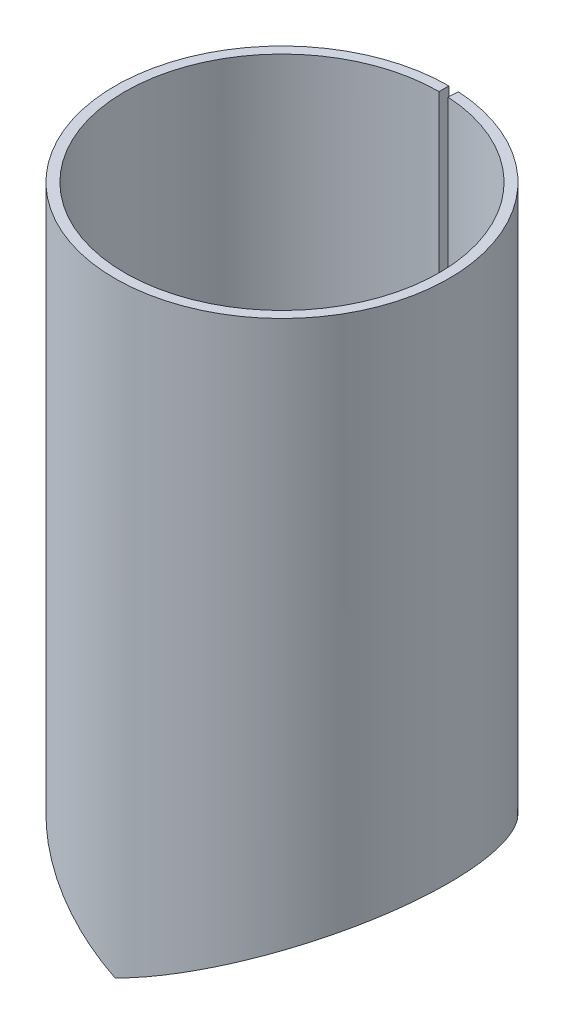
ISO-10303-21;
HEADER;
FILE_DESCRIPTION(('STEP AP214'),'2;1');
FILE_NAME('part.step','',(''),(''),'','','');
FILE_SCHEMA(('AUTOMOTIVE_DESIGN { 1 0 10303 214 1 1 1 1 }'));
ENDSEC;
DATA;
#1=APPLICATION_CONTEXT('core data for automotive mechanical design processes');
#2=APPLICATION_PROTOCOL_DEFINITION('international standard','automotive_design',2000,#1);
#3=PRODUCT_CONTEXT('',#1,'mechanical');
#4=PRODUCT('Part','Part','',(#3));
#5=PRODUCT_RELATED_PRODUCT_CATEGORY('part','',(#4));
#6=PRODUCT_DEFINITION_FORMATION('','',#4);
#7=PRODUCT_DEFINITION_CONTEXT('part definition',#1,'design');
#8=PRODUCT_DEFINITION('design','',#6,#7);
#9=PRODUCT_DEFINITION_SHAPE('','',#8);
#10=(LENGTH_UNIT() NAMED_UNIT(*) SI_UNIT(.MILLI.,.METRE.));
#11=(NAMED_UNIT(*) PLANE_ANGLE_UNIT() SI_UNIT($,.RADIAN.));
#12=(NAMED_UNIT(*) SI_UNIT($,.STERADIAN.) SOLID_ANGLE_UNIT());
#13=UNCERTAINTY_MEASURE_WITH_UNIT(LENGTH_MEASURE(1.E-05),#10,'distance_accuracy_value','');
#14=(GEOMETRIC_REPRESENTATION_CONTEXT(3) GLOBAL_UNCERTAINTY_ASSIGNED_CONTEXT((#13)) GLOBAL_UNIT_ASSIGNED_CONTEXT((#10,
#11,#12)) REPRESENTATION_CONTEXT('',''));
#15=CARTESIAN_POINT('',(0.,0.,0.));
#16=DIRECTION('',(0.,0.,1.));
#17=DIRECTION('',(1.,0.,0.));
#18=AXIS2_PLACEMENT_3D('',#15,#16,#17);
#19=CARTESIAN_POINT('',(0.941097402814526,31.0541779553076,-15.9494394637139));
#20=DIRECTION('',(-0.998263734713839,0.,-0.0589025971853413));
#21=DIRECTION('',(0.,1.,0.));
#22=AXIS2_PLACEMENT_3D('',#19,#20,#21);
#23=PLANE('',#22);
#24=CARTESIAN_POINT('',(0.94109740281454,0.493059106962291,-15.9494394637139));
#25=CARTESIAN_POINT('',(0.999999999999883,0.493059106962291,-16.9477031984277));
#26=B_SPLINE_CURVE_WITH_KNOTS('',1,(#24,#25),.UNSPECIFIED.,.F.,.F.,(2,2),(0.,1.),.UNSPECIFIED.);
#27=CARTESIAN_POINT('',(0.941097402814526,0.49305910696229,-15.9494394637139));
#28=VERTEX_POINT('',#27);
#29=CARTESIAN_POINT('',(0.999999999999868,0.49305910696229,-16.9477031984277));
#30=VERTEX_POINT('',#29);
#31=EDGE_CURVE('E13',#28,#30,#26,.T.);
#32=ORIENTED_EDGE('',*,*,#31,.F.);
#33=DIRECTION('',(0.,1.,0.));
#34=VECTOR('',#33,1.);
#35=CARTESIAN_POINT('',(0.941097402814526,0.49305910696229,-15.9494394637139));
#36=LINE('',#35,#34);
#37=CARTESIAN_POINT('',(0.941097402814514,61.615296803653,-15.9494394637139));
#38=VERTEX_POINT('',#37);
#39=EDGE_CURVE('E150',#28,#38,#36,.T.);
#40=ORIENTED_EDGE('',*,*,#39,.T.);
#41=DIRECTION('',(0.0589025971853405,0.,-0.998263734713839));
#42=VECTOR('',#41,1.);
#43=CARTESIAN_POINT('',(0.941097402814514,61.615296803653,-15.9494394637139));
#44=LINE('',#43,#42);
#45=CARTESIAN_POINT('',(0.999999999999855,61.615296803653,-16.9477031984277));
#46=VERTEX_POINT('',#45);
#47=EDGE_CURVE('E52',#38,#46,#44,.T.);
#48=ORIENTED_EDGE('',*,*,#47,.T.);
#49=DIRECTION('',(0.,-1.,0.));
#50=VECTOR('',#49,1.);
#51=CARTESIAN_POINT('',(0.999999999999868,178.606492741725,-16.9477031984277));
#52=LINE('',#51,#50);
#53=EDGE_CURVE('E111',#30,#46,#52,.F.);
#54=ORIENTED_EDGE('',*,*,#53,.F.);
#55=EDGE_LOOP('',(#32,#40,#48,#54));
#56=FACE_BOUND('',#55,.T.);
#57=ADVANCED_FACE('F38',(#56),#23,.T.);
#58=CARTESIAN_POINT('',(0.,61.615296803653,0.));
#59=DIRECTION('',(0.,-1.,0.));
#60=DIRECTION('',(0.,0.,-1.));
#61=AXIS2_PLACEMENT_3D('',#58,#59,#60);
#62=PLANE('',#61);
#63=ORIENTED_EDGE('',*,*,#47,.F.);
#64=CARTESIAN_POINT('',(0.,61.615296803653,0.));
#65=DIRECTION('',(0.,1.,0.));
#66=DIRECTION('',(0.,0.,1.));
#67=AXIS2_PLACEMENT_3D('',#64,#65,#66);
#68=CIRCLE('',#67,15.9771800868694);
#69=CARTESIAN_POINT('',(0.,61.615296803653,-15.9771800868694));
#70=VERTEX_POINT('',#69);
#71=EDGE_CURVE('E101',#70,#38,#68,.T.);
#72=ORIENTED_EDGE('',*,*,#71,.F.);
#73=DIRECTION('',(0.,0.,-1.));
#74=VECTOR('',#73,1.);
#75=CARTESIAN_POINT('',(0.,61.615296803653,-15.9771800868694));
#76=LINE('',#75,#74);
#77=CARTESIAN_POINT('',(0.,61.615296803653,-16.9771800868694));
#78=VERTEX_POINT('',#77);
#79=EDGE_CURVE('E97',#70,#78,#76,.T.);
#80=ORIENTED_EDGE('',*,*,#79,.T.);
#81=CARTESIAN_POINT('',(0.,61.615296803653,0.));
#82=DIRECTION('',(0.,-1.,0.));
#83=DIRECTION('',(0.,0.,-1.));
#84=AXIS2_PLACEMENT_3D('',#81,#82,#83);
#85=CIRCLE('',#84,16.9771800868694);
#86=EDGE_CURVE('E100',#78,#46,#85,.F.);
#87=ORIENTED_EDGE('',*,*,#86,.T.);
#88=EDGE_LOOP('',(#63,#72,#80,#87));
#89=FACE_BOUND('',#88,.T.);
#90=ADVANCED_FACE('F99',(#89),#62,.F.);
#91=CARTESIAN_POINT('',(0.,30.8076484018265,-15.9771800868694));
#92=DIRECTION('',(-1.,0.,0.));
#93=DIRECTION('',(0.,1.,0.));
#94=AXIS2_PLACEMENT_3D('',#91,#92,#93);
#95=PLANE('',#94);
#96=ORIENTED_EDGE('',*,*,#79,.F.);
#97=DIRECTION('',(0.,1.,0.));
#98=VECTOR('',#97,1.);
#99=CARTESIAN_POINT('',(0.,0.,-15.9771800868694));
#100=LINE('',#99,#98);
#101=CARTESIAN_POINT('',(0.,0.,-15.9771800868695));
#102=VERTEX_POINT('',#101);
#103=EDGE_CURVE('E151',#102,#70,#100,.T.);
#104=ORIENTED_EDGE('',*,*,#103,.F.);
#105=CARTESIAN_POINT('',(0.,0.,-16.9771800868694));
#106=CARTESIAN_POINT('',(0.,0.,-15.9771800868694));
#107=B_SPLINE_CURVE_WITH_KNOTS('',1,(#105,#106),.UNSPECIFIED.,.F.,.F.,(2,2),(0.,1.),.UNSPECIFIED.);
#108=CARTESIAN_POINT('',(0.,0.,-16.9771800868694));
#109=VERTEX_POINT('',#108);
#110=EDGE_CURVE('E93',#102,#109,#107,.F.);
#111=ORIENTED_EDGE('',*,*,#110,.T.);
#112=DIRECTION('',(0.,-1.,0.));
#113=VECTOR('',#112,1.);
#114=CARTESIAN_POINT('',(0.,178.606492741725,-16.9771800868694));
#115=LINE('',#114,#113);
#116=EDGE_CURVE('E108',#109,#78,#115,.F.);
#117=ORIENTED_EDGE('',*,*,#116,.T.);
#118=EDGE_LOOP('',(#96,#104,#111,#117));
#119=FACE_BOUND('',#118,.T.);
#120=ADVANCED_FACE('F113',(#119),#95,.F.);
#121=CARTESIAN_POINT('',(0.,0.,-16.9771800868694));
#122=CARTESIAN_POINT('',(-0.789612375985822,0.389318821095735,-16.9771800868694));
#123=CARTESIAN_POINT('',(-1.46662508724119,0.722575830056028,-16.9232026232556));
#124=CARTESIAN_POINT('',(-2.31055936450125,1.13886504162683,-16.8216004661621));
#125=CARTESIAN_POINT('',(-2.56336455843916,1.26366781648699,-16.7840888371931));
#126=CARTESIAN_POINT('',(-2.90022889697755,1.42993153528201,-16.7280086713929));
#127=CARTESIAN_POINT('',(-3.00546348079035,1.48186270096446,-16.7093331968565));
#128=CARTESIAN_POINT('',(-3.20192488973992,1.57874488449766,-16.6728013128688));
#129=CARTESIAN_POINT('',(-3.29705064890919,1.62563711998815,-16.6542346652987));
#130=CARTESIAN_POINT('',(-4.15347149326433,2.04782411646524,-16.4795915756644));
#131=CARTESIAN_POINT('',(-4.85290902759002,2.39257341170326,-16.2827270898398));
#132=CARTESIAN_POINT('',(-5.64927110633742,2.78534998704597,-16.0105811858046));
#133=CARTESIAN_POINT('',(-5.80466751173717,2.86199729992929,-15.9548321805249));
#134=CARTESIAN_POINT('',(-6.10776721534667,3.01147592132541,-15.8412756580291));
#135=CARTESIAN_POINT('',(-6.25504184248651,3.08408934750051,-15.7836574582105));
#136=CARTESIAN_POINT('',(-6.69215517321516,3.2995879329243,-15.6057262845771));
#137=CARTESIAN_POINT('',(-6.97540379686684,3.43920986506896,-15.4809847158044));
#138=CARTESIAN_POINT('',(-7.80043637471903,3.84594428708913,-15.0913168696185));
#139=CARTESIAN_POINT('',(-8.31743843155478,4.10092540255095,-14.8109961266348));
#140=CARTESIAN_POINT('',(-9.04386814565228,4.45913432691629,-14.370569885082));
#141=CARTESIAN_POINT('',(-9.27785089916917,4.57447908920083,-14.2204857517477));
#142=CARTESIAN_POINT('',(-9.73493463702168,4.79981380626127,-13.9115700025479));
#143=CARTESIAN_POINT('',(-9.95734719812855,4.90946228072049,-13.7531398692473));
#144=CARTESIAN_POINT('',(-10.6061380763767,5.22935105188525,-13.2674934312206));
#145=CARTESIAN_POINT('',(-11.0140382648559,5.43053469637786,-12.9299414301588));
#146=CARTESIAN_POINT('',(-11.781085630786,5.80875091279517,-12.2351316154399));
#147=CARTESIAN_POINT('',(-12.141354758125,5.98630554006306,-11.8770482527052));
#148=CARTESIAN_POINT('',(-12.8220763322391,6.32191989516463,-11.138722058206));
#149=CARTESIAN_POINT('',(-13.1415079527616,6.47945821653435,-10.7593821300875));
#150=CARTESIAN_POINT('',(-13.7387438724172,6.77399714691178,-9.985512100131));
#151=CARTESIAN_POINT('',(-14.016292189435,6.91081843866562,-9.59151371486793));
#152=CARTESIAN_POINT('',(-14.534257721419,7.16615948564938,-8.78686147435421));
#153=CARTESIAN_POINT('',(-14.7741403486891,7.28443147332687,-8.37681787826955));
#154=CARTESIAN_POINT('',(-15.4364534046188,7.611051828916,-7.12931822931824));
#155=CARTESIAN_POINT('',(-15.8012941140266,7.79090401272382,-6.27648734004));
#156=CARTESIAN_POINT('',(-16.3882178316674,8.07975035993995,-4.52785879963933));
#157=CARTESIAN_POINT('',(-16.6086035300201,8.18824656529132,-3.63460316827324));
#158=CARTESIAN_POINT('',(-16.902355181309,8.33338503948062,-1.83478629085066));
#159=CARTESIAN_POINT('',(-16.975732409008,8.37002730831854,-0.92824605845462));
#160=CARTESIAN_POINT('',(-16.9785852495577,8.37145790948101,0.874513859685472));
#161=CARTESIAN_POINT('',(-16.9081099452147,8.33623801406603,1.78090553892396));
#162=CARTESIAN_POINT('',(-16.6201527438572,8.19392681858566,3.58138649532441));
#163=CARTESIAN_POINT('',(-16.4026589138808,8.08683568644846,4.47524953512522));
#164=CARTESIAN_POINT('',(-15.9667096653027,7.87229568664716,5.78804238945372));
#165=CARTESIAN_POINT('',(-15.8031405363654,7.79179846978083,6.22096705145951));
#166=CARTESIAN_POINT('',(-15.4399863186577,7.61283626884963,7.07435540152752));
#167=CARTESIAN_POINT('',(-15.240004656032,7.51417964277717,7.49589384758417));
#168=CARTESIAN_POINT('',(-14.8012950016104,7.29782721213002,8.32873536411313));
#169=CARTESIAN_POINT('',(-14.5628024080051,7.18023536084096,8.73946825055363));
#170=CARTESIAN_POINT('',(-14.0475346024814,6.92622038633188,9.54569488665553));
#171=CARTESIAN_POINT('',(-13.7713177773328,6.79006277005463,9.94052794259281));
#172=CARTESIAN_POINT('',(-13.1769334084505,6.49693655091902,10.715956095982));
#173=CARTESIAN_POINT('',(-12.8589289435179,6.34010018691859,11.0961450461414));
#174=CARTESIAN_POINT('',(-12.1810507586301,6.00588095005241,11.8363208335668));
#175=CARTESIAN_POINT('',(-11.8221277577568,5.82898709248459,12.1954549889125));
#176=CARTESIAN_POINT('',(-11.0582967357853,5.45235163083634,12.8920867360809));
#177=CARTESIAN_POINT('',(-10.6518358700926,5.25185849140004,13.2308282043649));
#178=CARTESIAN_POINT('',(-10.0048652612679,4.93285566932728,13.7186099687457));
#179=CARTESIAN_POINT('',(-9.78300305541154,4.82347754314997,13.8778101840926));
#180=CARTESIAN_POINT('',(-9.32689389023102,4.59863358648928,14.1883689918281));
#181=CARTESIAN_POINT('',(-9.09334758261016,4.48352227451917,14.3393100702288));
#182=CARTESIAN_POINT('',(-8.36865177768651,4.12620252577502,14.7821131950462));
#183=CARTESIAN_POINT('',(-7.85207500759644,3.87140409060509,15.0645724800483));
#184=CARTESIAN_POINT('',(-7.02637586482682,3.46432853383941,15.4579310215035));
#185=CARTESIAN_POINT('',(-6.7426880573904,3.32449036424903,15.5839823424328));
#186=CARTESIAN_POINT('',(-6.30456963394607,3.1085136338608,15.7639453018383));
#187=CARTESIAN_POINT('',(-6.15705796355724,3.03579573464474,15.8221862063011));
#188=CARTESIAN_POINT('',(-5.85370898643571,2.88620787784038,15.9369077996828));
#189=CARTESIAN_POINT('',(-5.69803379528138,2.80942416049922,15.9932985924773));
#190=CARTESIAN_POINT('',(-4.89948053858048,2.4155566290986,16.2688800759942));
#191=CARTESIAN_POINT('',(-4.19572167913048,2.06862598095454,16.4692457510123));
#192=CARTESIAN_POINT('',(-3.33129422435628,1.64251280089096,16.6474244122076));
#193=CARTESIAN_POINT('',(-3.23424319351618,1.5946694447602,16.666561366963));
#194=CARTESIAN_POINT('',(-3.03814649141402,1.49798783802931,16.7034206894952));
#195=CARTESIAN_POINT('',(-2.93320155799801,1.44620688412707,16.7222599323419));
#196=CARTESIAN_POINT('',(-2.59583940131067,1.27970644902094,16.7791025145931));
#197=CARTESIAN_POINT('',(-2.34161966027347,1.15419859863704,16.8173489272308));
#198=CARTESIAN_POINT('',(-1.49011294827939,0.73415236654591,16.9213256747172));
#199=CARTESIAN_POINT('',(-0.803588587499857,0.396208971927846,16.9771800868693));
#200=CARTESIAN_POINT('',(1.19083122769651E-13,0.,16.9771800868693));
#201=CARTESIAN_POINT('',(0.,0.,-15.9771800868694));
#202=CARTESIAN_POINT('',(-0.743096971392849,0.389316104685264,-15.9771800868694));
#203=CARTESIAN_POINT('',(-1.38023706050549,0.722575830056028,-15.9263820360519));
#204=CARTESIAN_POINT('',(-2.17446141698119,1.13886504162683,-15.8307645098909));
#205=CARTESIAN_POINT('',(-2.41237572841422,1.26366781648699,-15.7954624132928));
#206=CARTESIAN_POINT('',(-2.72939788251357,1.42993153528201,-15.7426855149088));
#207=CARTESIAN_POINT('',(-2.82843387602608,1.48186270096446,-15.7251100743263));
#208=CARTESIAN_POINT('',(-3.01332319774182,1.57874488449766,-15.6907300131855));
#209=CARTESIAN_POINT('',(-3.1028458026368,1.62563711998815,-15.6732569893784));
#210=CARTESIAN_POINT('',(-3.90882123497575,2.04782411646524,-15.508900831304));
#211=CARTESIAN_POINT('',(-4.56706008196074,2.39257341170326,-15.323632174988));
#212=CARTESIAN_POINT('',(-5.31651436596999,2.78534998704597,-15.0675163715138));
#213=CARTESIAN_POINT('',(-5.46275751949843,2.86199729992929,-15.0150511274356));
#214=CARTESIAN_POINT('',(-5.74800386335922,3.01147592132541,-14.9081833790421));
#215=CARTESIAN_POINT('',(-5.88660363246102,3.08408934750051,-14.853959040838));
#216=CARTESIAN_POINT('',(-6.29796985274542,3.2995879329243,-14.6865084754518));
#217=CARTESIAN_POINT('',(-6.56453439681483,3.43920986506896,-14.5691145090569));
#218=CARTESIAN_POINT('',(-7.34097041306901,3.84594428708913,-14.2023991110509));
#219=CARTESIAN_POINT('',(-7.82751970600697,4.10092540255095,-13.9385899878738));
#220=CARTESIAN_POINT('',(-8.51116082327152,4.45913432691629,-13.5241059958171));
#221=CARTESIAN_POINT('',(-8.73136138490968,4.57447908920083,-13.3828622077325));
#222=CARTESIAN_POINT('',(-9.16152170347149,4.79981380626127,-13.092142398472));
#223=CARTESIAN_POINT('',(-9.37083358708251,4.90946228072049,-12.9430442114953));
#224=CARTESIAN_POINT('',(-9.98140899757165,5.22935105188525,-12.4860036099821));
#225=CARTESIAN_POINT('',(-10.3652828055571,5.43053469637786,-12.168334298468));
#226=CARTESIAN_POINT('',(-11.0871490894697,5.80875091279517,-11.5144505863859));
#227=CARTESIAN_POINT('',(-11.4261974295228,5.98630554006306,-11.1774592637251));
#228=CARTESIAN_POINT('',(-12.0668227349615,6.32191989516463,-10.482622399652));
#229=CARTESIAN_POINT('',(-12.367439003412,6.47945821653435,-10.1256265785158));
#230=CARTESIAN_POINT('',(-12.9294961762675,6.77399714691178,-9.39733950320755));
#231=CARTESIAN_POINT('',(-13.1906961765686,6.91081843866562,-9.02654864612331));
#232=CARTESIAN_POINT('',(-13.6781521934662,7.16615948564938,-8.26929251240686));
#233=CARTESIAN_POINT('',(-13.9039051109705,7.28443147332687,-7.88340154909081));
#234=CARTESIAN_POINT('',(-14.5272062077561,7.611051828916,-6.70938286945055));
#235=CARTESIAN_POINT('',(-14.8705568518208,7.79090401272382,-5.90678593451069));
#236=CARTESIAN_POINT('',(-15.4229092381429,8.07975035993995,-4.26115615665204));
#237=CARTESIAN_POINT('',(-15.6303136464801,8.18824656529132,-3.42051560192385));
#238=CARTESIAN_POINT('',(-15.9067625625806,8.33338503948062,-1.72671261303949));
#239=CARTESIAN_POINT('',(-15.9758176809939,8.37002730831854,-0.873569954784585));
#240=CARTESIAN_POINT('',(-15.9785024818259,8.37145790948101,0.823002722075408));
#241=CARTESIAN_POINT('',(-15.9121783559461,8.33623801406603,1.67600557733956));
#242=CARTESIAN_POINT('',(-15.6411825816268,8.19392681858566,3.37043352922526));
#243=CARTESIAN_POINT('',(-15.4364997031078,8.08683568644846,4.21164571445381));
#244=CARTESIAN_POINT('',(-15.0262289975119,7.87229568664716,5.44711166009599));
#245=CARTESIAN_POINT('',(-14.8722945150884,7.79179846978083,5.85453593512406));
#246=CARTESIAN_POINT('',(-14.5305310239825,7.61283626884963,6.65765749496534));
#247=CARTESIAN_POINT('',(-14.3423288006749,7.51417964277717,7.05436623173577));
#248=CARTESIAN_POINT('',(-13.929460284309,7.29782721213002,7.8381512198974));
#249=CARTESIAN_POINT('',(-13.7050155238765,7.18023536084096,8.22469087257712));
#250=CARTESIAN_POINT('',(-13.2200983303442,6.92622038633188,8.98342866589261));
#251=CARTESIAN_POINT('',(-12.9601513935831,6.79006277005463,9.35500502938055));
#252=CARTESIAN_POINT('',(-12.4007778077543,6.49693655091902,10.0847584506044));
#253=CARTESIAN_POINT('',(-12.1015046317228,6.34010018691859,10.4425532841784));
#254=CARTESIAN_POINT('',(-11.4635552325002,6.00588095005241,11.1391307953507));
#255=CARTESIAN_POINT('',(-11.1257737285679,5.82898709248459,11.4771110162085));
#256=CARTESIAN_POINT('',(-10.4069343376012,5.45235163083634,12.132709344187));
#257=CARTESIAN_POINT('',(-10.0244150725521,5.25185849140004,12.4514980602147));
#258=CARTESIAN_POINT('',(-9.41555271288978,4.93285566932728,12.9105482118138));
#259=CARTESIAN_POINT('',(-9.20675876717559,4.82347754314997,13.0603711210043));
#260=CARTESIAN_POINT('',(-8.77751561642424,4.59863358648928,13.3526372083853));
#261=CARTESIAN_POINT('',(-8.55772579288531,4.48352227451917,13.4946874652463));
#262=CARTESIAN_POINT('',(-7.87571645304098,4.12620252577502,13.9114083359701));
#263=CARTESIAN_POINT('',(-7.38956739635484,3.87140409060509,14.1772300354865));
#264=CARTESIAN_POINT('',(-6.61250407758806,3.46432853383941,14.5474187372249));
#265=CARTESIAN_POINT('',(-6.34552621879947,3.32449036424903,14.6660453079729));
#266=CARTESIAN_POINT('',(-5.93321410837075,3.1085136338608,14.8354079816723));
#267=CARTESIAN_POINT('',(-5.79439125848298,3.03579573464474,14.8902183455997));
#268=CARTESIAN_POINT('',(-5.50891032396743,2.88620787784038,14.998182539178));
#269=CARTESIAN_POINT('',(-5.36240480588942,2.80942416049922,15.0512517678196));
#270=CARTESIAN_POINT('',(-4.61088840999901,2.4155566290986,15.3106007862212));
#271=CARTESIAN_POINT('',(-3.94858277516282,2.06862598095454,15.4991644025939));
#272=CARTESIAN_POINT('',(-3.13507234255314,1.64251280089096,15.6668478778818));
#273=CARTESIAN_POINT('',(-3.04373786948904,1.5946694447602,15.6848576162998));
#274=CARTESIAN_POINT('',(-2.85919177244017,1.49798783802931,15.7195458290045));
#275=CARTESIAN_POINT('',(-2.76042836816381,1.44620688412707,15.7372753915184));
#276=CARTESIAN_POINT('',(-2.44293771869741,1.27970644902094,15.7907697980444));
#277=CARTESIAN_POINT('',(-2.20369218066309,1.15419859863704,15.8267633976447));
#278=CARTESIAN_POINT('',(-1.40234142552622,0.73415236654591,15.9246156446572));
#279=CARTESIAN_POINT('',(-0.756249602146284,0.396206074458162,15.9771800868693));
#280=CARTESIAN_POINT('',(1.12299319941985E-13,0.,15.9771800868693));
#281=B_SPLINE_SURFACE_WITH_KNOTS('',1,3,((#121,#122,#123,#124,#125,#126,#127,#128,#129,#130,
#131,#132,#133,#134,#135,#136,#137,#138,#139,#140,#141,#142,#143,#144,#145,#146,#147,#148,#149,
#150,#151,#152,#153,#154,#155,#156,#157,#158,#159,#160,#161,#162,#163,#164,#165,#166,#167,#168,
#169,#170,#171,#172,#173,#174,#175,#176,#177,#178,#179,#180,#181,#182,#183,#184,#185,#186,#187,
#188,#189,#190,#191,#192,#193,#194,#195,#196,#197,#198,#199,#200),(#201,#202,#203,#204,#205,
#206,#207,#208,#209,#210,#211,#212,#213,#214,#215,#216,#217,#218,#219,#220,#221,#222,#223,#224,
#225,#226,#227,#228,#229,#230,#231,#232,#233,#234,#235,#236,#237,#238,#239,#240,#241,#242,#243,
#244,#245,#246,#247,#248,#249,#250,#251,#252,#253,#254,#255,#256,#257,#258,#259,#260,#261,#262,
#263,#264,#265,#266,#267,#268,#269,#270,#271,#272,#273,#274,#275,#276,#277,#278,#279,#280)),
.UNSPECIFIED.,.F.,.F.,.F.,(2,2),(4,2,2,2,2,2,2,2,2,2,2,2,2,2,2,2,2,2,2,2,2,2,2,2,2,2,2,2,2,2,2,
2,2,2,2,2,2,2,2,4),(0.,1.),(0.,0.015625,0.0234375,0.02734375,0.03125,0.0625,0.0703125,0.078125,
0.09375,0.125,0.140625,0.15625,0.1875,0.21875,0.25,0.28125,0.3125,0.375,0.4375,0.5,0.5625,0.625,
0.65625,0.6875,0.71875,0.75,0.78125,0.8125,0.84375,0.859375,0.875,0.90625,0.921875,0.9296875,
0.9375,0.96875,0.97265625,0.9765625,0.984375,1.),.UNSPECIFIED.);
#282=CARTESIAN_POINT('',(0.,0.,-15.9771800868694));
#283=CARTESIAN_POINT('',(-0.743096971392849,0.389316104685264,-15.9771800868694));
#284=CARTESIAN_POINT('',(-1.38023706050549,0.722575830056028,-15.9263820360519));
#285=CARTESIAN_POINT('',(-2.17446141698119,1.13886504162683,-15.8307645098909));
#286=CARTESIAN_POINT('',(-2.41237572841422,1.26366781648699,-15.7954624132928));
#287=CARTESIAN_POINT('',(-2.72939788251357,1.42993153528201,-15.7426855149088));
#288=CARTESIAN_POINT('',(-2.82843387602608,1.48186270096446,-15.7251100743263));
#289=CARTESIAN_POINT('',(-3.01332319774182,1.57874488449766,-15.6907300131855));
#290=CARTESIAN_POINT('',(-3.1028458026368,1.62563711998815,-15.6732569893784));
#291=CARTESIAN_POINT('',(-3.90882123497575,2.04782411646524,-15.508900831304));
#292=CARTESIAN_POINT('',(-4.56706008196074,2.39257341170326,-15.323632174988));
#293=CARTESIAN_POINT('',(-5.31651436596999,2.78534998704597,-15.0675163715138));
#294=CARTESIAN_POINT('',(-5.46275751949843,2.86199729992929,-15.0150511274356));
#295=CARTESIAN_POINT('',(-5.74800386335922,3.01147592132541,-14.9081833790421));
#296=CARTESIAN_POINT('',(-5.88660363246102,3.08408934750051,-14.853959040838));
#297=CARTESIAN_POINT('',(-6.29796985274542,3.2995879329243,-14.6865084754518));
#298=CARTESIAN_POINT('',(-6.56453439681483,3.43920986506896,-14.5691145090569));
#299=CARTESIAN_POINT('',(-7.34097041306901,3.84594428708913,-14.2023991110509));
#300=CARTESIAN_POINT('',(-7.82751970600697,4.10092540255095,-13.9385899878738));
#301=CARTESIAN_POINT('',(-8.51116082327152,4.45913432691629,-13.5241059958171));
#302=CARTESIAN_POINT('',(-8.73136138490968,4.57447908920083,-13.3828622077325));
#303=CARTESIAN_POINT('',(-9.16152170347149,4.79981380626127,-13.092142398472));
#304=CARTESIAN_POINT('',(-9.37083358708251,4.90946228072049,-12.9430442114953));
#305=CARTESIAN_POINT('',(-9.98140899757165,5.22935105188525,-12.4860036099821));
#306=CARTESIAN_POINT('',(-10.3652828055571,5.43053469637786,-12.168334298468));
#307=CARTESIAN_POINT('',(-11.0871490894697,5.80875091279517,-11.5144505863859));
#308=CARTESIAN_POINT('',(-11.4261974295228,5.98630554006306,-11.1774592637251));
#309=CARTESIAN_POINT('',(-12.0668227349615,6.32191989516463,-10.482622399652));
#310=CARTESIAN_POINT('',(-12.367439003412,6.47945821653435,-10.1256265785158));
#311=CARTESIAN_POINT('',(-12.9294961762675,6.77399714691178,-9.39733950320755));
#312=CARTESIAN_POINT('',(-13.1906961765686,6.91081843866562,-9.02654864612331));
#313=CARTESIAN_POINT('',(-13.6781521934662,7.16615948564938,-8.26929251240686));
#314=CARTESIAN_POINT('',(-13.9039051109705,7.28443147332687,-7.88340154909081));
#315=CARTESIAN_POINT('',(-14.5272062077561,7.611051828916,-6.70938286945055));
#316=CARTESIAN_POINT('',(-14.8705568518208,7.79090401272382,-5.90678593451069));
#317=CARTESIAN_POINT('',(-15.4229092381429,8.07975035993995,-4.26115615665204));
#318=CARTESIAN_POINT('',(-15.6303136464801,8.18824656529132,-3.42051560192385));
#319=CARTESIAN_POINT('',(-15.9067625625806,8.33338503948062,-1.72671261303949));
#320=CARTESIAN_POINT('',(-15.9758176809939,8.37002730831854,-0.873569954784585));
#321=CARTESIAN_POINT('',(-15.9785024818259,8.37145790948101,0.823002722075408));
#322=CARTESIAN_POINT('',(-15.9121783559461,8.33623801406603,1.67600557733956));
#323=CARTESIAN_POINT('',(-15.6411825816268,8.19392681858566,3.37043352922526));
#324=CARTESIAN_POINT('',(-15.4364997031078,8.08683568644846,4.21164571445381));
#325=CARTESIAN_POINT('',(-15.0262289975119,7.87229568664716,5.44711166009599));
#326=CARTESIAN_POINT('',(-14.8722945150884,7.79179846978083,5.85453593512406));
#327=CARTESIAN_POINT('',(-14.5305310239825,7.61283626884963,6.65765749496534));
#328=CARTESIAN_POINT('',(-14.3423288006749,7.51417964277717,7.05436623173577));
#329=CARTESIAN_POINT('',(-13.929460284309,7.29782721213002,7.8381512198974));
#330=CARTESIAN_POINT('',(-13.7050155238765,7.18023536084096,8.22469087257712));
#331=CARTESIAN_POINT('',(-13.2200983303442,6.92622038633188,8.98342866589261));
#332=CARTESIAN_POINT('',(-12.9601513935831,6.79006277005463,9.35500502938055));
#333=CARTESIAN_POINT('',(-12.4007778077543,6.49693655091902,10.0847584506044));
#334=CARTESIAN_POINT('',(-12.1015046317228,6.34010018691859,10.4425532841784));
#335=CARTESIAN_POINT('',(-11.4635552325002,6.00588095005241,11.1391307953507));
#336=CARTESIAN_POINT('',(-11.1257737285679,5.82898709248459,11.4771110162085));
#337=CARTESIAN_POINT('',(-10.4069343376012,5.45235163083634,12.132709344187));
#338=CARTESIAN_POINT('',(-10.0244150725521,5.25185849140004,12.4514980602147));
#339=CARTESIAN_POINT('',(-9.41555271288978,4.93285566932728,12.9105482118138));
#340=CARTESIAN_POINT('',(-9.20675876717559,4.82347754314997,13.0603711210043));
#341=CARTESIAN_POINT('',(-8.77751561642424,4.59863358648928,13.3526372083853));
#342=CARTESIAN_POINT('',(-8.55772579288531,4.48352227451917,13.4946874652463));
#343=CARTESIAN_POINT('',(-7.87571645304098,4.12620252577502,13.9114083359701));
#344=CARTESIAN_POINT('',(-7.38956739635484,3.87140409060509,14.1772300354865));
#345=CARTESIAN_POINT('',(-6.61250407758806,3.46432853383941,14.5474187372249));
#346=CARTESIAN_POINT('',(-6.34552621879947,3.32449036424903,14.6660453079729));
#347=CARTESIAN_POINT('',(-5.93321410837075,3.1085136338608,14.8354079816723));
#348=CARTESIAN_POINT('',(-5.79439125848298,3.03579573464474,14.8902183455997));
#349=CARTESIAN_POINT('',(-5.50891032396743,2.88620787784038,14.998182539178));
#350=CARTESIAN_POINT('',(-5.36240480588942,2.80942416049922,15.0512517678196));
#351=CARTESIAN_POINT('',(-4.61088840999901,2.4155566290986,15.3106007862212));
#352=CARTESIAN_POINT('',(-3.94858277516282,2.06862598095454,15.4991644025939));
#353=CARTESIAN_POINT('',(-3.13507234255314,1.64251280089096,15.6668478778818));
#354=CARTESIAN_POINT('',(-3.04373786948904,1.5946694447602,15.6848576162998));
#355=CARTESIAN_POINT('',(-2.85919177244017,1.49798783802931,15.7195458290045));
#356=CARTESIAN_POINT('',(-2.76042836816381,1.44620688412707,15.7372753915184));
#357=CARTESIAN_POINT('',(-2.44293771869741,1.27970644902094,15.7907697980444));
#358=CARTESIAN_POINT('',(-2.20369218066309,1.15419859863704,15.8267633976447));
#359=CARTESIAN_POINT('',(-1.40234142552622,0.73415236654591,15.9246156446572));
#360=CARTESIAN_POINT('',(-0.756249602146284,0.396206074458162,15.9771800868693));
#361=CARTESIAN_POINT('',(1.12299319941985E-13,0.,15.9771800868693));
#362=B_SPLINE_CURVE_WITH_KNOTS('',3,(#282,#283,#284,#285,#286,#287,#288,#289,#290,#291,#292,
#293,#294,#295,#296,#297,#298,#299,#300,#301,#302,#303,#304,#305,#306,#307,#308,#309,#310,#311,
#312,#313,#314,#315,#316,#317,#318,#319,#320,#321,#322,#323,#324,#325,#326,#327,#328,#329,#330,
#331,#332,#333,#334,#335,#336,#337,#338,#339,#340,#341,#342,#343,#344,#345,#346,#347,#348,#349,
#350,#351,#352,#353,#354,#355,#356,#357,#358,#359,#360,#361),.UNSPECIFIED.,.F.,.F.,(4,2,2,2,2,2,
2,2,2,2,2,2,2,2,2,2,2,2,2,2,2,2,2,2,2,2,2,2,2,2,2,2,2,2,2,2,2,2,2,4),(0.,0.015625,0.0234375,
0.02734375,0.03125,0.0625,0.0703125,0.078125,0.09375,0.125,0.140625,0.15625,0.1875,0.21875,0.25,
0.28125,0.3125,0.375,0.4375,0.5,0.5625,0.625,0.65625,0.6875,0.71875,0.75,0.78125,0.8125,0.84375,
0.859375,0.875,0.90625,0.921875,0.9296875,0.9375,0.96875,0.97265625,0.9765625,0.984375,1.),.UNSPECIFIED.);
#363=CARTESIAN_POINT('',(1.12299319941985E-13,0.,15.9771800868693));
#364=VERTEX_POINT('',#363);
#365=EDGE_CURVE('E154',#102,#364,#362,.T.);
#366=CARTESIAN_POINT('',(1.12299319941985E-13,0.,15.9771800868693));
#367=CARTESIAN_POINT('',(1.19083122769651E-13,0.,16.9771800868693));
#368=B_SPLINE_CURVE_WITH_KNOTS('',1,(#366,#367),.UNSPECIFIED.,.F.,.F.,(2,2),(0.,1.),.UNSPECIFIED.);
#369=CARTESIAN_POINT('',(-5.07065438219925E-07,2.50008429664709E-07,16.9771800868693));
#370=VERTEX_POINT('',#369);
#371=EDGE_CURVE('E269',#364,#370,#368,.T.);
#372=CARTESIAN_POINT('',(1.19083122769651E-13,0.,16.9771800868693));
#373=CARTESIAN_POINT('',(-0.803588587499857,0.396208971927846,16.9771800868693));
#374=CARTESIAN_POINT('',(-1.49011294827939,0.73415236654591,16.9213256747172));
#375=CARTESIAN_POINT('',(-2.34161966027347,1.15419859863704,16.8173489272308));
#376=CARTESIAN_POINT('',(-2.59583940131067,1.27970644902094,16.7791025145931));
#377=CARTESIAN_POINT('',(-2.93320155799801,1.44620688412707,16.7222599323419));
#378=CARTESIAN_POINT('',(-3.03814649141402,1.49798783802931,16.7034206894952));
#379=CARTESIAN_POINT('',(-3.23424319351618,1.5946694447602,16.666561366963));
#380=CARTESIAN_POINT('',(-3.33129422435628,1.64251280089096,16.6474244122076));
#381=CARTESIAN_POINT('',(-4.19572167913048,2.06862598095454,16.4692457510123));
#382=CARTESIAN_POINT('',(-4.89948053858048,2.4155566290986,16.2688800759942));
#383=CARTESIAN_POINT('',(-5.69803379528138,2.80942416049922,15.9932985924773));
#384=CARTESIAN_POINT('',(-5.85370898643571,2.88620787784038,15.9369077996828));
#385=CARTESIAN_POINT('',(-6.15705796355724,3.03579573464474,15.8221862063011));
#386=CARTESIAN_POINT('',(-6.30456963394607,3.1085136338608,15.7639453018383));
#387=CARTESIAN_POINT('',(-6.7426880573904,3.32449036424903,15.5839823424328));
#388=CARTESIAN_POINT('',(-7.02637586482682,3.46432853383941,15.4579310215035));
#389=CARTESIAN_POINT('',(-7.85207500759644,3.87140409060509,15.0645724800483));
#390=CARTESIAN_POINT('',(-8.36865177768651,4.12620252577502,14.7821131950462));
#391=CARTESIAN_POINT('',(-9.09334758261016,4.48352227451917,14.3393100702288));
#392=CARTESIAN_POINT('',(-9.32689389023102,4.59863358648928,14.1883689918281));
#393=CARTESIAN_POINT('',(-9.78300305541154,4.82347754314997,13.8778101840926));
#394=CARTESIAN_POINT('',(-10.0048652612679,4.93285566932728,13.7186099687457));
#395=CARTESIAN_POINT('',(-10.6518358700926,5.25185849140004,13.2308282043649));
#396=CARTESIAN_POINT('',(-11.0582967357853,5.45235163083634,12.8920867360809));
#397=CARTESIAN_POINT('',(-11.8221277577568,5.82898709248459,12.1954549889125));
#398=CARTESIAN_POINT('',(-12.1810507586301,6.00588095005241,11.8363208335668));
#399=CARTESIAN_POINT('',(-12.8589289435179,6.34010018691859,11.0961450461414));
#400=CARTESIAN_POINT('',(-13.1769334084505,6.49693655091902,10.715956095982));
#401=CARTESIAN_POINT('',(-13.7713177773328,6.79006277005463,9.94052794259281));
#402=CARTESIAN_POINT('',(-14.0475346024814,6.92622038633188,9.54569488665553));
#403=CARTESIAN_POINT('',(-14.5628024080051,7.18023536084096,8.73946825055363));
#404=CARTESIAN_POINT('',(-14.8012950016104,7.29782721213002,8.32873536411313));
#405=CARTESIAN_POINT('',(-15.240004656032,7.51417964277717,7.49589384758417));
#406=CARTESIAN_POINT('',(-15.4399863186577,7.61283626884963,7.07435540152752));
#407=CARTESIAN_POINT('',(-15.8031405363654,7.79179846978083,6.22096705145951));
#408=CARTESIAN_POINT('',(-15.9667096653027,7.87229568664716,5.78804238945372));
#409=CARTESIAN_POINT('',(-16.4026589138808,8.08683568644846,4.47524953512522));
#410=CARTESIAN_POINT('',(-16.6201527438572,8.19392681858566,3.58138649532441));
#411=CARTESIAN_POINT('',(-16.9081099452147,8.33623801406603,1.78090553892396));
#412=CARTESIAN_POINT('',(-16.9785852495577,8.37145790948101,0.874513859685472));
#413=CARTESIAN_POINT('',(-16.975732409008,8.37002730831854,-0.92824605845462));
#414=CARTESIAN_POINT('',(-16.902355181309,8.33338503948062,-1.83478629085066));
#415=CARTESIAN_POINT('',(-16.6086035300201,8.18824656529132,-3.63460316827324));
#416=CARTESIAN_POINT('',(-16.3882178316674,8.07975035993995,-4.52785879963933));
#417=CARTESIAN_POINT('',(-15.8012941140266,7.79090401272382,-6.27648734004));
#418=CARTESIAN_POINT('',(-15.4364534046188,7.611051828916,-7.12931822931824));
#419=CARTESIAN_POINT('',(-14.7741403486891,7.28443147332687,-8.37681787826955));
#420=CARTESIAN_POINT('',(-14.534257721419,7.16615948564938,-8.78686147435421));
#421=CARTESIAN_POINT('',(-14.016292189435,6.91081843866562,-9.59151371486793));
#422=CARTESIAN_POINT('',(-13.7387438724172,6.77399714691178,-9.985512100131));
#423=CARTESIAN_POINT('',(-13.1415079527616,6.47945821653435,-10.7593821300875));
#424=CARTESIAN_POINT('',(-12.8220763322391,6.32191989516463,-11.138722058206));
#425=CARTESIAN_POINT('',(-12.141354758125,5.98630554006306,-11.8770482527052));
#426=CARTESIAN_POINT('',(-11.781085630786,5.80875091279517,-12.2351316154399));
#427=CARTESIAN_POINT('',(-11.0140382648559,5.43053469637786,-12.9299414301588));
#428=CARTESIAN_POINT('',(-10.6061380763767,5.22935105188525,-13.2674934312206));
#429=CARTESIAN_POINT('',(-9.95734719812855,4.90946228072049,-13.7531398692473));
#430=CARTESIAN_POINT('',(-9.73493463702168,4.79981380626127,-13.9115700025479));
#431=CARTESIAN_POINT('',(-9.27785089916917,4.57447908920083,-14.2204857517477));
#432=CARTESIAN_POINT('',(-9.04386814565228,4.45913432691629,-14.370569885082));
#433=CARTESIAN_POINT('',(-8.31743843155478,4.10092540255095,-14.8109961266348));
#434=CARTESIAN_POINT('',(-7.80043637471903,3.84594428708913,-15.0913168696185));
#435=CARTESIAN_POINT('',(-6.97540379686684,3.43920986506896,-15.4809847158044));
#436=CARTESIAN_POINT('',(-6.69215517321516,3.2995879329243,-15.6057262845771));
#437=CARTESIAN_POINT('',(-6.25504184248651,3.08408934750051,-15.7836574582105));
#438=CARTESIAN_POINT('',(-6.10776721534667,3.01147592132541,-15.8412756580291));
#439=CARTESIAN_POINT('',(-5.80466751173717,2.86199729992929,-15.9548321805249));
#440=CARTESIAN_POINT('',(-5.64927110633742,2.78534998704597,-16.0105811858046));
#441=CARTESIAN_POINT('',(-4.85290902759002,2.39257341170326,-16.2827270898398));
#442=CARTESIAN_POINT('',(-4.15347149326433,2.04782411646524,-16.4795915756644));
#443=CARTESIAN_POINT('',(-3.29705064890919,1.62563711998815,-16.6542346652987));
#444=CARTESIAN_POINT('',(-3.20192488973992,1.57874488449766,-16.6728013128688));
#445=CARTESIAN_POINT('',(-3.00546348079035,1.48186270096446,-16.7093331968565));
#446=CARTESIAN_POINT('',(-2.90022889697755,1.42993153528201,-16.7280086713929));
#447=CARTESIAN_POINT('',(-2.56336455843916,1.26366781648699,-16.7840888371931));
#448=CARTESIAN_POINT('',(-2.31055936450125,1.13886504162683,-16.8216004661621));
#449=CARTESIAN_POINT('',(-1.46662508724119,0.722575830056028,-16.9232026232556));
#450=CARTESIAN_POINT('',(-0.789612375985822,0.389318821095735,-16.9771800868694));
#451=CARTESIAN_POINT('',(0.,0.,-16.9771800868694));
#452=B_SPLINE_CURVE_WITH_KNOTS('',3,(#372,#373,#374,#375,#376,#377,#378,#379,#380,#381,#382,
#383,#384,#385,#386,#387,#388,#389,#390,#391,#392,#393,#394,#395,#396,#397,#398,#399,#400,#401,
#402,#403,#404,#405,#406,#407,#408,#409,#410,#411,#412,#413,#414,#415,#416,#417,#418,#419,#420,
#421,#422,#423,#424,#425,#426,#427,#428,#429,#430,#431,#432,#433,#434,#435,#436,#437,#438,#439,
#440,#441,#442,#443,#444,#445,#446,#447,#448,#449,#450,#451),.UNSPECIFIED.,.F.,.F.,(4,2,2,2,2,2,
2,2,2,2,2,2,2,2,2,2,2,2,2,2,2,2,2,2,2,2,2,2,2,2,2,2,2,2,2,2,2,2,2,4),(0.,0.015625,0.0234375,
0.02734375,0.03125,0.0625,0.0703125,0.078125,0.09375,0.125,0.140625,0.15625,0.1875,0.21875,0.25,
0.28125,0.3125,0.34375,0.375,0.4375,0.5,0.5625,0.625,0.6875,0.71875,0.75,0.78125,0.8125,0.84375,
0.859375,0.875,0.90625,0.921875,0.9296875,0.9375,0.96875,0.97265625,0.9765625,0.984375,1.),.UNSPECIFIED.);
#453=EDGE_CURVE('E114',#109,#370,#452,.F.);
#454=ORIENTED_EDGE('',*,*,#110,.F.);
#455=ORIENTED_EDGE('',*,*,#365,.T.);
#456=ORIENTED_EDGE('',*,*,#371,.T.);
#457=ORIENTED_EDGE('',*,*,#453,.F.);
#458=EDGE_LOOP('',(#454,#455,#456,#457));
#459=FACE_BOUND('',#458,.T.);
#460=ADVANCED_FACE('F139',(#459),#281,.T.);
#461=CARTESIAN_POINT('',(1.19083122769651E-13,0.,16.9771800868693));
#462=CARTESIAN_POINT('',(0.794864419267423,0.39190859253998,16.9771800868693));
#463=CARTESIAN_POINT('',(1.47329775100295,0.725887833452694,16.9225453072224));
#464=CARTESIAN_POINT('',(2.31374267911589,1.14047675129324,16.8211433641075));
#465=CARTESIAN_POINT('',(2.56445148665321,1.26424783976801,16.7838816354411));
#466=CARTESIAN_POINT('',(2.89680168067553,1.42826664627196,16.7285921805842));
#467=CARTESIAN_POINT('',(2.99931875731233,1.47884246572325,16.7104322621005));
#468=CARTESIAN_POINT('',(3.19414285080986,1.57490042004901,16.674288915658));
#469=CARTESIAN_POINT('',(3.29057205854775,1.62243879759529,16.6555175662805));
#470=CARTESIAN_POINT('',(4.14953366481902,2.04586879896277,16.4806895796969));
#471=CARTESIAN_POINT('',(4.84937165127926,2.39085264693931,16.2837219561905));
#472=CARTESIAN_POINT('',(5.64412565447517,2.78283448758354,16.0123920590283));
#473=CARTESIAN_POINT('',(5.79909559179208,2.859268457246,15.9568523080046));
#474=CARTESIAN_POINT('',(6.10113978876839,3.00821159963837,15.8438233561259));
#475=CARTESIAN_POINT('',(6.24860737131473,3.0809127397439,15.7862083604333));
#476=CARTESIAN_POINT('',(6.68647262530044,3.29677490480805,15.6081717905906));
#477=CARTESIAN_POINT('',(6.97002091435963,3.43654849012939,15.483410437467));
#478=CARTESIAN_POINT('',(7.79538536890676,3.84346567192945,15.0939324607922));
#479=CARTESIAN_POINT('',(8.31185102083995,4.09820569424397,14.8140742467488));
#480=CARTESIAN_POINT('',(9.27808807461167,4.57460954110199,14.2288701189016));
#481=CARTESIAN_POINT('',(9.73445071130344,4.79955680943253,13.9196417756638));
#482=CARTESIAN_POINT('',(10.5989604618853,5.22583727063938,13.273205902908));
#483=CARTESIAN_POINT('',(11.0061888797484,5.42670338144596,12.9365582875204));
#484=CARTESIAN_POINT('',(12.1538504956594,5.99247935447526,11.8984420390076));
#485=CARTESIAN_POINT('',(12.8332061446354,6.32747585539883,11.1571709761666));
#486=CARTESIAN_POINT('',(13.7271946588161,6.76830853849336,10.0013009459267));
#487=CARTESIAN_POINT('',(14.004711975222,6.90508343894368,9.60835961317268));
#488=CARTESIAN_POINT('',(14.5225059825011,7.16036327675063,8.80621098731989));
#489=CARTESIAN_POINT('',(14.7622212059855,7.27857833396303,8.39770843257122));
#490=CARTESIAN_POINT('',(15.2034047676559,7.49615872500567,7.56975331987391));
#491=CARTESIAN_POINT('',(15.4045666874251,7.59536572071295,7.15109955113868));
#492=CARTESIAN_POINT('',(15.7713369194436,7.77602118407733,6.301097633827));
#493=CARTESIAN_POINT('',(15.936736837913,7.857415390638,5.86997089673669));
#494=CARTESIAN_POINT('',(16.3783566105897,8.07479743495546,4.56290051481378));
#495=CARTESIAN_POINT('',(16.5998688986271,8.18398469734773,3.67329711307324));
#496=CARTESIAN_POINT('',(16.822665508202,8.29416444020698,2.32993514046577));
#497=CARTESIAN_POINT('',(16.8787181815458,8.32195749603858,1.8806484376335));
#498=CARTESIAN_POINT('',(16.9547508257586,8.35967655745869,0.982033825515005));
#499=CARTESIAN_POINT('',(16.9747527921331,8.36958749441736,0.533552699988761));
#500=CARTESIAN_POINT('',(16.9858547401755,8.37471194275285,-1.71512583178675));
#501=CARTESIAN_POINT('',(16.7063471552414,8.23660196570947,-3.53291738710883));
#502=CARTESIAN_POINT('',(15.9945437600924,7.8862025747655,-5.71044172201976));
#503=CARTESIAN_POINT('',(15.8346531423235,7.80744635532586,-6.14019447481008));
#504=CARTESIAN_POINT('',(15.4771536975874,7.6310079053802,-6.99256331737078));
#505=CARTESIAN_POINT('',(15.2792851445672,7.53324727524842,-7.41551656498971));
#506=CARTESIAN_POINT('',(14.6273860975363,7.21134116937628,-8.66899109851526));
#507=CARTESIAN_POINT('',(14.1148504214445,6.95857147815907,-9.48421764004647));
#508=CARTESIAN_POINT('',(13.2288660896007,6.52216851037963,-10.6517806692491));
#509=CARTESIAN_POINT('',(12.9140587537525,6.36715944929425,-11.0317311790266));
#510=CARTESIAN_POINT('',(12.2461046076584,6.03805851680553,-11.7688116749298));
#511=CARTESIAN_POINT('',(11.8933583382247,5.86408768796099,-12.1258325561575));
#512=CARTESIAN_POINT('',(11.1395511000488,5.49233589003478,-12.8217857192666));
#513=CARTESIAN_POINT('',(10.7396336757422,5.29514065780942,-13.159352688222));
#514=CARTESIAN_POINT('',(9.89368706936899,4.87811152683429,-13.8066379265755));
#515=CARTESIAN_POINT('',(9.44880942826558,4.65879113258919,-14.1158849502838));
#516=CARTESIAN_POINT('',(8.49810065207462,4.18999485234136,-14.7078378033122));
#517=CARTESIAN_POINT('',(7.99382963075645,3.94138616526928,-14.9891786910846));
#518=CARTESIAN_POINT('',(7.19426046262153,3.54715731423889,-15.3803542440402));
#519=CARTESIAN_POINT('',(6.92189574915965,3.41283761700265,-15.505081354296));
#520=CARTESIAN_POINT('',(6.35289355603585,3.13219525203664,-15.7467752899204));
#521=CARTESIAN_POINT('',(6.05691338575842,2.98621870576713,-15.8633311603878));
#522=CARTESIAN_POINT('',(5.44183783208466,2.68295488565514,-16.0847093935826));
#523=CARTESIAN_POINT('',(5.12274066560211,2.5256676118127,-16.1895311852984));
#524=CARTESIAN_POINT('',(4.62686241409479,2.28125365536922,-16.3354361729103));
#525=CARTESIAN_POINT('',(4.45870008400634,2.19836849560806,-16.3821815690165));
#526=CARTESIAN_POINT('',(4.11668640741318,2.02977049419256,-16.4714532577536));
#527=CARTESIAN_POINT('',(3.94446346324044,1.94485837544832,-16.513692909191));
#528=CARTESIAN_POINT('',(3.38782714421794,1.67024979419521,-16.6400744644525));
#529=CARTESIAN_POINT('',(2.97265780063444,1.4653583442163,-16.7213676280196));
#530=CARTESIAN_POINT('',(2.05298402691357,1.01193731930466,-16.8590060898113));
#531=CARTESIAN_POINT('',(1.54847628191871,0.76343208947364,-16.9153403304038));
#532=CARTESIAN_POINT('',(0.999999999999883,0.493059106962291,-16.9477031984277));
#533=CARTESIAN_POINT('',(1.12299319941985E-13,0.,15.9771800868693));
#534=CARTESIAN_POINT('',(0.748039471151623,0.391905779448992,15.9771800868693));
#535=CARTESIAN_POINT('',(1.38651668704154,0.725887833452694,15.9257634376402));
#536=CARTESIAN_POINT('',(2.17745722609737,1.14047675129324,15.8303343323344));
#537=CARTESIAN_POINT('',(2.4133986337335,1.26424783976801,15.7952674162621));
#538=CARTESIAN_POINT('',(2.72617253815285,1.42826664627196,15.7432346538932));
#539=CARTESIAN_POINT('',(2.8226510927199,1.47884246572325,15.7261444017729));
#540=CARTESIAN_POINT('',(3.00599954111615,1.57490042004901,15.6921299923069));
#541=CARTESIAN_POINT('',(3.09674881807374,1.62243879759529,15.6744643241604));
#542=CARTESIAN_POINT('',(3.90511535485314,2.04586879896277,15.5099341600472));
#543=CARTESIAN_POINT('',(4.56373106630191,2.39085264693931,15.3245684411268));
#544=CARTESIAN_POINT('',(5.31167199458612,2.78283448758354,15.0692205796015));
#545=CARTESIAN_POINT('',(5.45751380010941,2.859268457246,15.0169522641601));
#546=CARTESIAN_POINT('',(5.74176680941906,3.00821159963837,14.9105810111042));
#547=CARTESIAN_POINT('',(5.88054816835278,3.0809127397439,14.8563596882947));
#548=CARTESIAN_POINT('',(6.2926220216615,3.29677490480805,14.6888099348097));
#549=CARTESIAN_POINT('',(6.55946858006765,3.43654849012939,14.5713973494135));
#550=CARTESIAN_POINT('',(7.33621692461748,3.84346567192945,14.2048606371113));
#551=CARTESIAN_POINT('',(7.82226140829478,4.09820569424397,13.9414867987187));
#552=CARTESIAN_POINT('',(8.73158459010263,4.57460954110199,13.3907527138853));
#553=CARTESIAN_POINT('',(9.1610662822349,4.79955680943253,13.0997387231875));
#554=CARTESIAN_POINT('',(9.97465416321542,5.22583727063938,12.4913796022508));
#555=CARTESIAN_POINT('',(10.3578957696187,5.42670338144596,12.1745614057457));
#556=CARTESIAN_POINT('',(11.4379571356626,5.99247935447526,11.1975929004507));
#557=CARTESIAN_POINT('',(12.0772969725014,6.32747585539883,10.4999846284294));
#558=CARTESIAN_POINT('',(12.918627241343,6.76830853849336,9.41219834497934));
#559=CARTESIAN_POINT('',(13.1797980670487,6.90508343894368,9.04240227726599));
#560=CARTESIAN_POINT('',(13.667092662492,7.16036327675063,8.28750228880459));
#561=CARTESIAN_POINT('',(13.8926880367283,7.27857833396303,7.90306159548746));
#562=CARTESIAN_POINT('',(14.3078847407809,7.49615872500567,7.12387518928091));
#563=CARTESIAN_POINT('',(14.4971977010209,7.59536572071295,6.72988121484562));
#564=CARTESIAN_POINT('',(14.8423642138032,7.77602118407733,5.92994661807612));
#565=CARTESIAN_POINT('',(14.9980216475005,7.857415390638,5.52421436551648));
#566=CARTESIAN_POINT('',(15.4136288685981,8.07479743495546,4.29413382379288));
#567=CARTESIAN_POINT('',(15.6220935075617,8.18398469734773,3.45693037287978));
#568=CARTESIAN_POINT('',(15.8317668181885,8.29416444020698,2.19269590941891));
#569=CARTESIAN_POINT('',(15.8845178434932,8.32195749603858,1.76987336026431));
#570=CARTESIAN_POINT('',(15.956071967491,8.35967655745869,0.924189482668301));
#571=CARTESIAN_POINT('',(15.9748957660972,8.36958749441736,0.502125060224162));
#572=CARTESIAN_POINT('',(15.9853437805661,8.37471194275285,-1.61410046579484));
#573=CARTESIAN_POINT('',(15.7222999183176,8.23660196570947,-3.32481937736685));
#574=CARTESIAN_POINT('',(15.0524235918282,7.8862025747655,-5.37408187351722));
#575=CARTESIAN_POINT('',(14.9019509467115,7.80744635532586,-5.77852107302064));
#576=CARTESIAN_POINT('',(14.5655091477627,7.6310079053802,-6.58068317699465));
#577=CARTESIAN_POINT('',(14.3792955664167,7.53324727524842,-6.97872337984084));
#578=CARTESIAN_POINT('',(13.7657950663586,7.21134116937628,-8.15836500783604));
#579=CARTESIAN_POINT('',(13.2834490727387,6.95857147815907,-8.92557258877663));
#580=CARTESIAN_POINT('',(12.449651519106,6.52216851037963,-10.0243631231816));
#581=CARTESIAN_POINT('',(12.1533871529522,6.36715944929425,-10.3819335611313));
#582=CARTESIAN_POINT('',(11.5247772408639,6.03805851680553,-11.0755981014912));
#583=CARTESIAN_POINT('',(11.1928086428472,5.86408768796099,-11.4115895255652));
#584=CARTESIAN_POINT('',(10.483402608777,5.49233589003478,-12.0665492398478));
#585=CARTESIAN_POINT('',(10.1070413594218,5.29514065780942,-12.3842326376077));
#586=CARTESIAN_POINT('',(9.31092320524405,4.87811152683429,-12.9933910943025));
#587=CARTESIAN_POINT('',(8.89225001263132,4.65879113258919,-13.2844226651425));
#588=CARTESIAN_POINT('',(7.99754045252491,4.18999485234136,-13.8415079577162));
#589=CARTESIAN_POINT('',(7.5229723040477,3.94138616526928,-14.1062771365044));
#590=CARTESIAN_POINT('',(6.77049983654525,3.54715731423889,-14.4744114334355));
#591=CARTESIAN_POINT('',(6.51417811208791,3.41283761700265,-14.5917917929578));
#592=CARTESIAN_POINT('',(5.97869162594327,3.13219525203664,-14.81924932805));
#593=CARTESIAN_POINT('',(5.70014545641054,2.98621870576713,-14.9289397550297));
#594=CARTESIAN_POINT('',(5.12129945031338,2.68295488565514,-15.137278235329));
#595=CARTESIAN_POINT('',(4.82099793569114,2.5256676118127,-15.2359257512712));
#596=CARTESIAN_POINT('',(4.35432820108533,2.28125365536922,-15.3732365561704));
#597=CARTESIAN_POINT('',(4.19607106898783,2.19836849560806,-15.4172285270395));
#598=CARTESIAN_POINT('',(3.87420288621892,2.02977049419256,-15.5012418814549));
#599=CARTESIAN_POINT('',(3.71212432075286,1.94485837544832,-15.5409935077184));
#600=CARTESIAN_POINT('',(3.18827532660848,1.67024979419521,-15.6599308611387));
#601=CARTESIAN_POINT('',(2.79756053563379,1.4653583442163,-15.7364356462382));
#602=CARTESIAN_POINT('',(1.93205793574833,1.01193731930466,-15.8659668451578));
#603=CARTESIAN_POINT('',(1.45726586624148,0.763431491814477,-15.9189829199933));
#604=CARTESIAN_POINT('',(0.94109740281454,0.493059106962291,-15.9494394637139));
#605=B_SPLINE_SURFACE_WITH_KNOTS('',1,3,((#461,#462,#463,#464,#465,#466,#467,#468,#469,#470,
#471,#472,#473,#474,#475,#476,#477,#478,#479,#480,#481,#482,#483,#484,#485,#486,#487,#488,#489,
#490,#491,#492,#493,#494,#495,#496,#497,#498,#499,#500,#501,#502,#503,#504,#505,#506,#507,#508,
#509,#510,#511,#512,#513,#514,#515,#516,#517,#518,#519,#520,#521,#522,#523,#524,#525,#526,#527,
#528,#529,#530,#531,#532),(#533,#534,#535,#536,#537,#538,#539,#540,#541,#542,#543,#544,#545,
#546,#547,#548,#549,#550,#551,#552,#553,#554,#555,#556,#557,#558,#559,#560,#561,#562,#563,#564,
#565,#566,#567,#568,#569,#570,#571,#572,#573,#574,#575,#576,#577,#578,#579,#580,#581,#582,#583,
#584,#585,#586,#587,#588,#589,#590,#591,#592,#593,#594,#595,#596,#597,#598,#599,#600,#601,#602,
#603,#604)),.UNSPECIFIED.,.F.,.F.,.F.,(2,2),(4,2,2,2,2,2,2,2,2,2,2,2,2,2,2,2,2,2,2,2,2,2,2,2,2,
2,2,2,2,2,2,2,2,2,2,4),(0.,1.),(0.,0.015625,0.0234375,0.02734375,0.03125,0.0625,0.0703125,
0.078125,0.09375,0.125,0.15625,0.1875,0.25,0.28125,0.3125,0.34375,0.375,0.4375,0.46875,0.5,
0.625,0.65625,0.6875,0.75,0.78125,0.8125,0.84375,0.875,0.90625,0.921875,0.9375,0.953125,
0.9609375,0.96875,0.984375,1.),.UNSPECIFIED.);
#606=CARTESIAN_POINT('',(1.12299319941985E-13,0.,15.9771800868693));
#607=CARTESIAN_POINT('',(0.748039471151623,0.391905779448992,15.9771800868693));
#608=CARTESIAN_POINT('',(1.38651668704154,0.725887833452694,15.9257634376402));
#609=CARTESIAN_POINT('',(2.17745722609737,1.14047675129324,15.8303343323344));
#610=CARTESIAN_POINT('',(2.4133986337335,1.26424783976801,15.7952674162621));
#611=CARTESIAN_POINT('',(2.72617253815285,1.42826664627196,15.7432346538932));
#612=CARTESIAN_POINT('',(2.8226510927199,1.47884246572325,15.7261444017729));
#613=CARTESIAN_POINT('',(3.00599954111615,1.57490042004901,15.6921299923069));
#614=CARTESIAN_POINT('',(3.09674881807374,1.62243879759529,15.6744643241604));
#615=CARTESIAN_POINT('',(3.90511535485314,2.04586879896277,15.5099341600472));
#616=CARTESIAN_POINT('',(4.56373106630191,2.39085264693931,15.3245684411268));
#617=CARTESIAN_POINT('',(5.31167199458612,2.78283448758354,15.0692205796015));
#618=CARTESIAN_POINT('',(5.45751380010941,2.859268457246,15.0169522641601));
#619=CARTESIAN_POINT('',(5.74176680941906,3.00821159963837,14.9105810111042));
#620=CARTESIAN_POINT('',(5.88054816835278,3.0809127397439,14.8563596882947));
#621=CARTESIAN_POINT('',(6.2926220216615,3.29677490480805,14.6888099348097));
#622=CARTESIAN_POINT('',(6.55946858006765,3.43654849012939,14.5713973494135));
#623=CARTESIAN_POINT('',(7.33621692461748,3.84346567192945,14.2048606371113));
#624=CARTESIAN_POINT('',(7.82226140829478,4.09820569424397,13.9414867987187));
#625=CARTESIAN_POINT('',(8.73158459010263,4.57460954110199,13.3907527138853));
#626=CARTESIAN_POINT('',(9.1610662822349,4.79955680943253,13.0997387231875));
#627=CARTESIAN_POINT('',(9.97465416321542,5.22583727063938,12.4913796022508));
#628=CARTESIAN_POINT('',(10.3578957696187,5.42670338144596,12.1745614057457));
#629=CARTESIAN_POINT('',(11.4379571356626,5.99247935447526,11.1975929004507));
#630=CARTESIAN_POINT('',(12.0772969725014,6.32747585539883,10.4999846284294));
#631=CARTESIAN_POINT('',(12.918627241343,6.76830853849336,9.41219834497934));
#632=CARTESIAN_POINT('',(13.1797980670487,6.90508343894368,9.04240227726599));
#633=CARTESIAN_POINT('',(13.667092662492,7.16036327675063,8.28750228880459));
#634=CARTESIAN_POINT('',(13.8926880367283,7.27857833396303,7.90306159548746));
#635=CARTESIAN_POINT('',(14.3078847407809,7.49615872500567,7.12387518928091));
#636=CARTESIAN_POINT('',(14.4971977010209,7.59536572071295,6.72988121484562));
#637=CARTESIAN_POINT('',(14.8423642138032,7.77602118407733,5.92994661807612));
#638=CARTESIAN_POINT('',(14.9980216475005,7.857415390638,5.52421436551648));
#639=CARTESIAN_POINT('',(15.4136288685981,8.07479743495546,4.29413382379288));
#640=CARTESIAN_POINT('',(15.6220935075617,8.18398469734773,3.45693037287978));
#641=CARTESIAN_POINT('',(15.8317668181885,8.29416444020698,2.19269590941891));
#642=CARTESIAN_POINT('',(15.8845178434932,8.32195749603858,1.76987336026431));
#643=CARTESIAN_POINT('',(15.956071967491,8.35967655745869,0.924189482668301));
#644=CARTESIAN_POINT('',(15.9748957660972,8.36958749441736,0.502125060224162));
#645=CARTESIAN_POINT('',(15.9853437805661,8.37471194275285,-1.61410046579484));
#646=CARTESIAN_POINT('',(15.7222999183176,8.23660196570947,-3.32481937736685));
#647=CARTESIAN_POINT('',(15.0524235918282,7.8862025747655,-5.37408187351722));
#648=CARTESIAN_POINT('',(14.9019509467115,7.80744635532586,-5.77852107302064));
#649=CARTESIAN_POINT('',(14.5655091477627,7.6310079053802,-6.58068317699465));
#650=CARTESIAN_POINT('',(14.3792955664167,7.53324727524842,-6.97872337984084));
#651=CARTESIAN_POINT('',(13.7657950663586,7.21134116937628,-8.15836500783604));
#652=CARTESIAN_POINT('',(13.2834490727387,6.95857147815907,-8.92557258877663));
#653=CARTESIAN_POINT('',(12.449651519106,6.52216851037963,-10.0243631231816));
#654=CARTESIAN_POINT('',(12.1533871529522,6.36715944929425,-10.3819335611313));
#655=CARTESIAN_POINT('',(11.5247772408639,6.03805851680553,-11.0755981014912));
#656=CARTESIAN_POINT('',(11.1928086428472,5.86408768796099,-11.4115895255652));
#657=CARTESIAN_POINT('',(10.483402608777,5.49233589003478,-12.0665492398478));
#658=CARTESIAN_POINT('',(10.1070413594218,5.29514065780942,-12.3842326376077));
#659=CARTESIAN_POINT('',(9.31092320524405,4.87811152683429,-12.9933910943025));
#660=CARTESIAN_POINT('',(8.89225001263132,4.65879113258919,-13.2844226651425));
#661=CARTESIAN_POINT('',(7.99754045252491,4.18999485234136,-13.8415079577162));
#662=CARTESIAN_POINT('',(7.5229723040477,3.94138616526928,-14.1062771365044));
#663=CARTESIAN_POINT('',(6.77049983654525,3.54715731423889,-14.4744114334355));
#664=CARTESIAN_POINT('',(6.51417811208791,3.41283761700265,-14.5917917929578));
#665=CARTESIAN_POINT('',(5.97869162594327,3.13219525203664,-14.81924932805));
#666=CARTESIAN_POINT('',(5.70014545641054,2.98621870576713,-14.9289397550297));
#667=CARTESIAN_POINT('',(5.12129945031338,2.68295488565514,-15.137278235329));
#668=CARTESIAN_POINT('',(4.82099793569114,2.5256676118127,-15.2359257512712));
#669=CARTESIAN_POINT('',(4.35432820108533,2.28125365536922,-15.3732365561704));
#670=CARTESIAN_POINT('',(4.19607106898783,2.19836849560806,-15.4172285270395));
#671=CARTESIAN_POINT('',(3.87420288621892,2.02977049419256,-15.5012418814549));
#672=CARTESIAN_POINT('',(3.71212432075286,1.94485837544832,-15.5409935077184));
#673=CARTESIAN_POINT('',(3.18827532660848,1.67024979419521,-15.6599308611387));
#674=CARTESIAN_POINT('',(2.79756053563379,1.4653583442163,-15.7364356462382));
#675=CARTESIAN_POINT('',(1.93205793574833,1.01193731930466,-15.8659668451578));
#676=CARTESIAN_POINT('',(1.45726586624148,0.763431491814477,-15.9189829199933));
#677=CARTESIAN_POINT('',(0.94109740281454,0.493059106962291,-15.9494394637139));
#678=B_SPLINE_CURVE_WITH_KNOTS('',3,(#606,#607,#608,#609,#610,#611,#612,#613,#614,#615,#616,
#617,#618,#619,#620,#621,#622,#623,#624,#625,#626,#627,#628,#629,#630,#631,#632,#633,#634,#635,
#636,#637,#638,#639,#640,#641,#642,#643,#644,#645,#646,#647,#648,#649,#650,#651,#652,#653,#654,
#655,#656,#657,#658,#659,#660,#661,#662,#663,#664,#665,#666,#667,#668,#669,#670,#671,#672,#673,
#674,#675,#676,#677),.UNSPECIFIED.,.F.,.F.,(4,2,2,2,2,2,2,2,2,2,2,2,2,2,2,2,2,2,2,2,2,2,2,2,2,2,
2,2,2,2,2,2,2,2,2,4),(0.,0.015625,0.0234375,0.02734375,0.03125,0.0625,0.0703125,0.078125,
0.09375,0.125,0.15625,0.1875,0.25,0.28125,0.3125,0.34375,0.375,0.4375,0.46875,0.5,0.625,0.65625,
0.6875,0.75,0.78125,0.8125,0.84375,0.875,0.90625,0.921875,0.9375,0.953125,0.9609375,0.96875,
0.984375,1.),.UNSPECIFIED.);
#679=EDGE_CURVE('E116',#364,#28,#678,.T.);
#680=CARTESIAN_POINT('',(0.999999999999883,0.493059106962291,-16.9477031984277));
#681=CARTESIAN_POINT('',(1.54847628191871,0.76343208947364,-16.9153403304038));
#682=CARTESIAN_POINT('',(2.05298402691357,1.01193731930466,-16.8590060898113));
#683=CARTESIAN_POINT('',(2.97265780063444,1.4653583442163,-16.7213676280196));
#684=CARTESIAN_POINT('',(3.38782714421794,1.67024979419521,-16.6400744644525));
#685=CARTESIAN_POINT('',(3.94446346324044,1.94485837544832,-16.513692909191));
#686=CARTESIAN_POINT('',(4.11668640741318,2.02977049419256,-16.4714532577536));
#687=CARTESIAN_POINT('',(4.45870008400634,2.19836849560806,-16.3821815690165));
#688=CARTESIAN_POINT('',(4.62686241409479,2.28125365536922,-16.3354361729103));
#689=CARTESIAN_POINT('',(5.12274066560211,2.5256676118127,-16.1895311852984));
#690=CARTESIAN_POINT('',(5.44183783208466,2.68295488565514,-16.0847093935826));
#691=CARTESIAN_POINT('',(6.05691338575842,2.98621870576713,-15.8633311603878));
#692=CARTESIAN_POINT('',(6.35289355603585,3.13219525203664,-15.7467752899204));
#693=CARTESIAN_POINT('',(6.92189574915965,3.41283761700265,-15.505081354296));
#694=CARTESIAN_POINT('',(7.19426046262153,3.54715731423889,-15.3803542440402));
#695=CARTESIAN_POINT('',(7.99382963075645,3.94138616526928,-14.9891786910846));
#696=CARTESIAN_POINT('',(8.49810065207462,4.18999485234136,-14.7078378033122));
#697=CARTESIAN_POINT('',(9.44880942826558,4.65879113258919,-14.1158849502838));
#698=CARTESIAN_POINT('',(9.89368706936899,4.87811152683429,-13.8066379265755));
#699=CARTESIAN_POINT('',(10.7396336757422,5.29514065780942,-13.159352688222));
#700=CARTESIAN_POINT('',(11.1395511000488,5.49233589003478,-12.8217857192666));
#701=CARTESIAN_POINT('',(11.8933583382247,5.86408768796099,-12.1258325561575));
#702=CARTESIAN_POINT('',(12.2461046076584,6.03805851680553,-11.7688116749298));
#703=CARTESIAN_POINT('',(12.9140587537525,6.36715944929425,-11.0317311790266));
#704=CARTESIAN_POINT('',(13.2288660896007,6.52216851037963,-10.6517806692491));
#705=CARTESIAN_POINT('',(14.1148504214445,6.95857147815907,-9.48421764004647));
#706=CARTESIAN_POINT('',(14.6273860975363,7.21134116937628,-8.66899109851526));
#707=CARTESIAN_POINT('',(15.2792851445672,7.53324727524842,-7.41551656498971));
#708=CARTESIAN_POINT('',(15.4771536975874,7.6310079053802,-6.99256331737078));
#709=CARTESIAN_POINT('',(15.8346531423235,7.80744635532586,-6.14019447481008));
#710=CARTESIAN_POINT('',(15.9945437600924,7.8862025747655,-5.71044172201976));
#711=CARTESIAN_POINT('',(16.7063471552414,8.23660196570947,-3.53291738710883));
#712=CARTESIAN_POINT('',(16.9858547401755,8.37471194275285,-1.71512583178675));
#713=CARTESIAN_POINT('',(16.9747527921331,8.36958749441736,0.533552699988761));
#714=CARTESIAN_POINT('',(16.9547508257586,8.35967655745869,0.982033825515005));
#715=CARTESIAN_POINT('',(16.8787181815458,8.32195749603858,1.8806484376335));
#716=CARTESIAN_POINT('',(16.822665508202,8.29416444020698,2.32993514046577));
#717=CARTESIAN_POINT('',(16.5998688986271,8.18398469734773,3.67329711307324));
#718=CARTESIAN_POINT('',(16.3783566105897,8.07479743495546,4.56290051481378));
#719=CARTESIAN_POINT('',(15.936736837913,7.857415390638,5.86997089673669));
#720=CARTESIAN_POINT('',(15.7713369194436,7.77602118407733,6.301097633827));
#721=CARTESIAN_POINT('',(15.4045666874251,7.59536572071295,7.15109955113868));
#722=CARTESIAN_POINT('',(15.2034047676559,7.49615872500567,7.56975331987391));
#723=CARTESIAN_POINT('',(14.7622212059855,7.27857833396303,8.39770843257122));
#724=CARTESIAN_POINT('',(14.5225059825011,7.16036327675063,8.80621098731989));
#725=CARTESIAN_POINT('',(14.004711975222,6.90508343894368,9.60835961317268));
#726=CARTESIAN_POINT('',(13.7271946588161,6.76830853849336,10.0013009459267));
#727=CARTESIAN_POINT('',(12.8332061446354,6.32747585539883,11.1571709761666));
#728=CARTESIAN_POINT('',(12.1538504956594,5.99247935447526,11.8984420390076));
#729=CARTESIAN_POINT('',(11.0061888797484,5.42670338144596,12.9365582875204));
#730=CARTESIAN_POINT('',(10.5989604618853,5.22583727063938,13.273205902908));
#731=CARTESIAN_POINT('',(9.73445071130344,4.79955680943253,13.9196417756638));
#732=CARTESIAN_POINT('',(9.27808807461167,4.57460954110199,14.2288701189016));
#733=CARTESIAN_POINT('',(8.31185102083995,4.09820569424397,14.8140742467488));
#734=CARTESIAN_POINT('',(7.79538536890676,3.84346567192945,15.0939324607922));
#735=CARTESIAN_POINT('',(6.97002091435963,3.43654849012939,15.483410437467));
#736=CARTESIAN_POINT('',(6.68647262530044,3.29677490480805,15.6081717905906));
#737=CARTESIAN_POINT('',(6.24860737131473,3.0809127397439,15.7862083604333));
#738=CARTESIAN_POINT('',(6.10113978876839,3.00821159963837,15.8438233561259));
#739=CARTESIAN_POINT('',(5.79909559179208,2.859268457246,15.9568523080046));
#740=CARTESIAN_POINT('',(5.64412565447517,2.78283448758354,16.0123920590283));
#741=CARTESIAN_POINT('',(4.84937165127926,2.39085264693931,16.2837219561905));
#742=CARTESIAN_POINT('',(4.14953366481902,2.04586879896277,16.4806895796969));
#743=CARTESIAN_POINT('',(3.29057205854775,1.62243879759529,16.6555175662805));
#744=CARTESIAN_POINT('',(3.19414285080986,1.57490042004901,16.674288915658));
#745=CARTESIAN_POINT('',(2.99931875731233,1.47884246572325,16.7104322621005));
#746=CARTESIAN_POINT('',(2.89680168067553,1.42826664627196,16.7285921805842));
#747=CARTESIAN_POINT('',(2.56445148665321,1.26424783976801,16.7838816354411));
#748=CARTESIAN_POINT('',(2.31374267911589,1.14047675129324,16.8211433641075));
#749=CARTESIAN_POINT('',(1.47329775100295,0.725887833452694,16.9225453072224));
#750=CARTESIAN_POINT('',(0.794864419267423,0.39190859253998,16.9771800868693));
#751=CARTESIAN_POINT('',(1.19083122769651E-13,0.,16.9771800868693));
#752=B_SPLINE_CURVE_WITH_KNOTS('',3,(#680,#681,#682,#683,#684,#685,#686,#687,#688,#689,#690,
#691,#692,#693,#694,#695,#696,#697,#698,#699,#700,#701,#702,#703,#704,#705,#706,#707,#708,#709,
#710,#711,#712,#713,#714,#715,#716,#717,#718,#719,#720,#721,#722,#723,#724,#725,#726,#727,#728,
#729,#730,#731,#732,#733,#734,#735,#736,#737,#738,#739,#740,#741,#742,#743,#744,#745,#746,#747,
#748,#749,#750,#751),.UNSPECIFIED.,.F.,.F.,(4,2,2,2,2,2,2,2,2,2,2,2,2,2,2,2,2,2,2,2,2,2,2,2,2,2,
2,2,2,2,2,2,2,2,2,4),(0.,0.015625,0.03125,0.0390625,0.046875,0.0625,0.078125,0.09375,0.125,
0.15625,0.1875,0.21875,0.25,0.3125,0.34375,0.375,0.5,0.53125,0.5625,0.625,0.65625,0.6875,
0.71875,0.75,0.8125,0.84375,0.875,0.90625,0.921875,0.9296875,0.9375,0.96875,0.97265625,
0.9765625,0.984375,1.),.UNSPECIFIED.);
#753=EDGE_CURVE('E270',#370,#30,#752,.F.);
#754=ORIENTED_EDGE('',*,*,#679,.T.);
#755=ORIENTED_EDGE('',*,*,#31,.T.);
#756=ORIENTED_EDGE('',*,*,#753,.F.);
#757=ORIENTED_EDGE('',*,*,#371,.F.);
#758=EDGE_LOOP('',(#754,#755,#756,#757));
#759=FACE_BOUND('',#758,.T.);
#760=ADVANCED_FACE('F40',(#759),#605,.T.);
#761=CARTESIAN_POINT('',(0.,178.606492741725,0.));
#762=DIRECTION('',(0.,-1.,0.));
#763=DIRECTION('',(0.,0.,-1.));
#764=AXIS2_PLACEMENT_3D('',#761,#762,#763);
#765=CYLINDRICAL_SURFACE('',#764,16.9771800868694);
#766=ORIENTED_EDGE('',*,*,#453,.T.);
#767=ORIENTED_EDGE('',*,*,#753,.T.);
#768=ORIENTED_EDGE('',*,*,#53,.T.);
#769=ORIENTED_EDGE('',*,*,#86,.F.);
#770=ORIENTED_EDGE('',*,*,#116,.F.);
#771=EDGE_LOOP('',(#766,#767,#768,#769,#770));
#772=FACE_BOUND('',#771,.T.);
#773=ADVANCED_FACE('F107',(#772),#765,.T.);
#774=CARTESIAN_POINT('',(0.,178.606492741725,0.));
#775=DIRECTION('',(0.,-1.,0.));
#776=DIRECTION('',(0.,0.,-1.));
#777=AXIS2_PLACEMENT_3D('',#774,#775,#776);
#778=CYLINDRICAL_SURFACE('',#777,15.9771800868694);
#779=ORIENTED_EDGE('',*,*,#365,.F.);
#780=ORIENTED_EDGE('',*,*,#103,.T.);
#781=ORIENTED_EDGE('',*,*,#71,.T.);
#782=ORIENTED_EDGE('',*,*,#39,.F.);
#783=ORIENTED_EDGE('',*,*,#679,.F.);
#784=EDGE_LOOP('',(#779,#780,#781,#782,#783));
#785=FACE_BOUND('',#784,.T.);
#786=ADVANCED_FACE('F138',(#785),#778,.F.);
#787=CLOSED_SHELL('',(#57,#90,#120,#460,#760,#773,#786));
#788=MANIFOLD_SOLID_BREP('B2',#787);
#789=ADVANCED_BREP_SHAPE_REPRESENTATION('',(#18,#788),#14);
#790=SHAPE_DEFINITION_REPRESENTATION(#9,#789);
ENDSEC;
END-ISO-10303-21;
